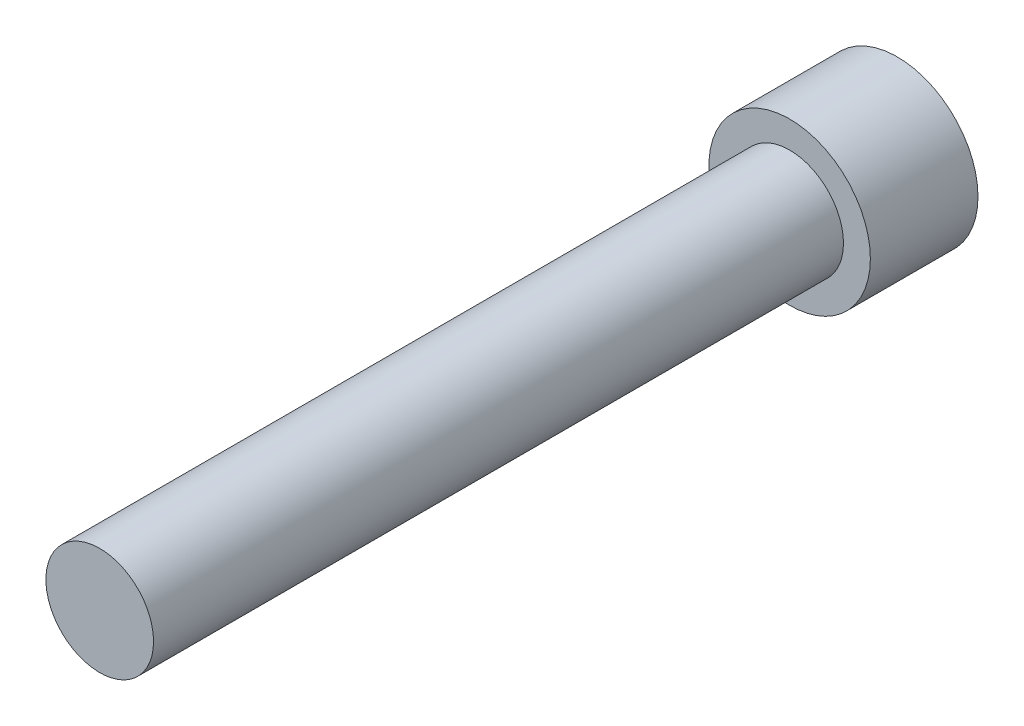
from build123d import *

# Parameters (mm, degrees)
HEX_2_DEPTH = 4.826


with BuildPart() as part:
    # Sketch6 → Revolve1 (revolve)
    with BuildSketch(Plane(origin=(0, 0, 0), x_dir=(0, 0, -1), z_dir=(1, 0, 0)), mode=Mode.PRIVATE) as revolve1_sk:
        Polygon((-50.8, 0), (-50.8, -3.9624), (0, -3.9624), (0, -5.9436), (7.9248, -5.9436), (7.9248, 0), align=None)
    revolve(revolve1_sk.sketch.rotate(Axis((0, 0, 50.8), (0, 0, -1)), 270), axis=Axis((0, 0, 50.8), (0, 0, -1)))

    # Sketch7 → HEX 2 (cut)
    with BuildSketch(Plane(origin=(0, 0, -7.9248), x_dir=(-1, 0, 0), z_dir=(0, 0, -1))):
        Polygon((-3.175, 1.833087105), (-3.175, -1.833087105), (0, -3.666174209), (3.175, -1.833087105), (3.175, 1.833087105), (0, 3.666174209), align=None)
    extrude(amount=-HEX_2_DEPTH, mode=Mode.SUBTRACT)


solid = part.part
